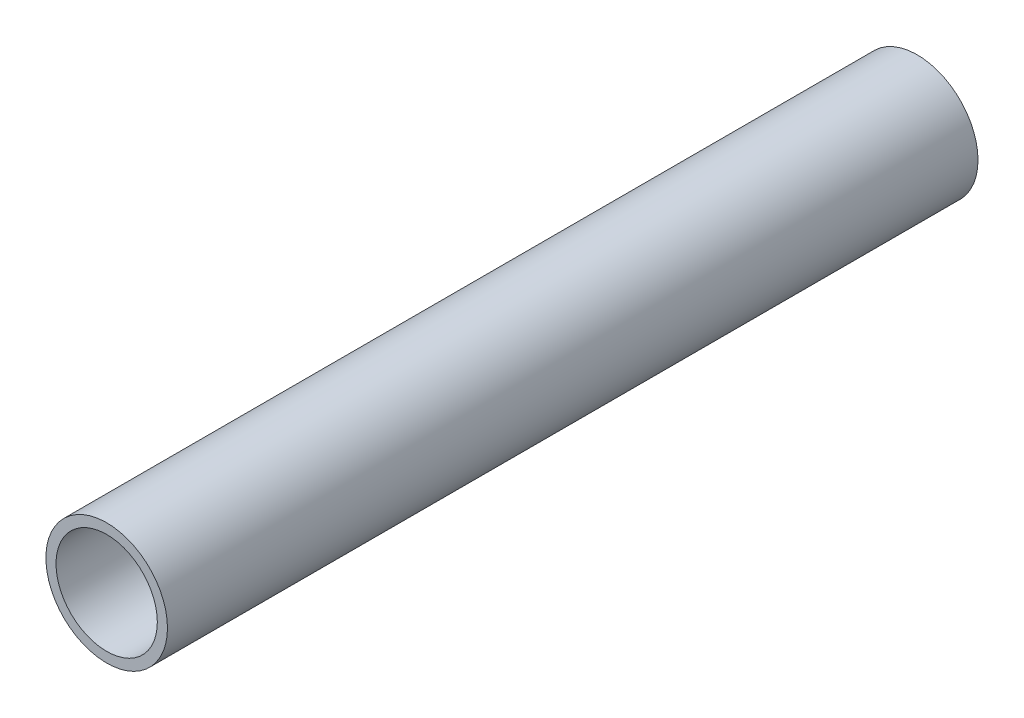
from build123d import *

# Parameters (mm, degrees)
ESQUISSE1_R      = 6
ESQUISSE1_R_2    = 5
EXTRUSION1_DEPTH = 40


with BuildPart() as part:
    # Esquisse1 → Extrusion1 (new, symmetric)
    with BuildSketch(Plane.XY):
        Circle(ESQUISSE1_R)
        Circle(ESQUISSE1_R_2, mode=Mode.SUBTRACT)
    extrude(amount=EXTRUSION1_DEPTH, both=True)


solid = part.part
